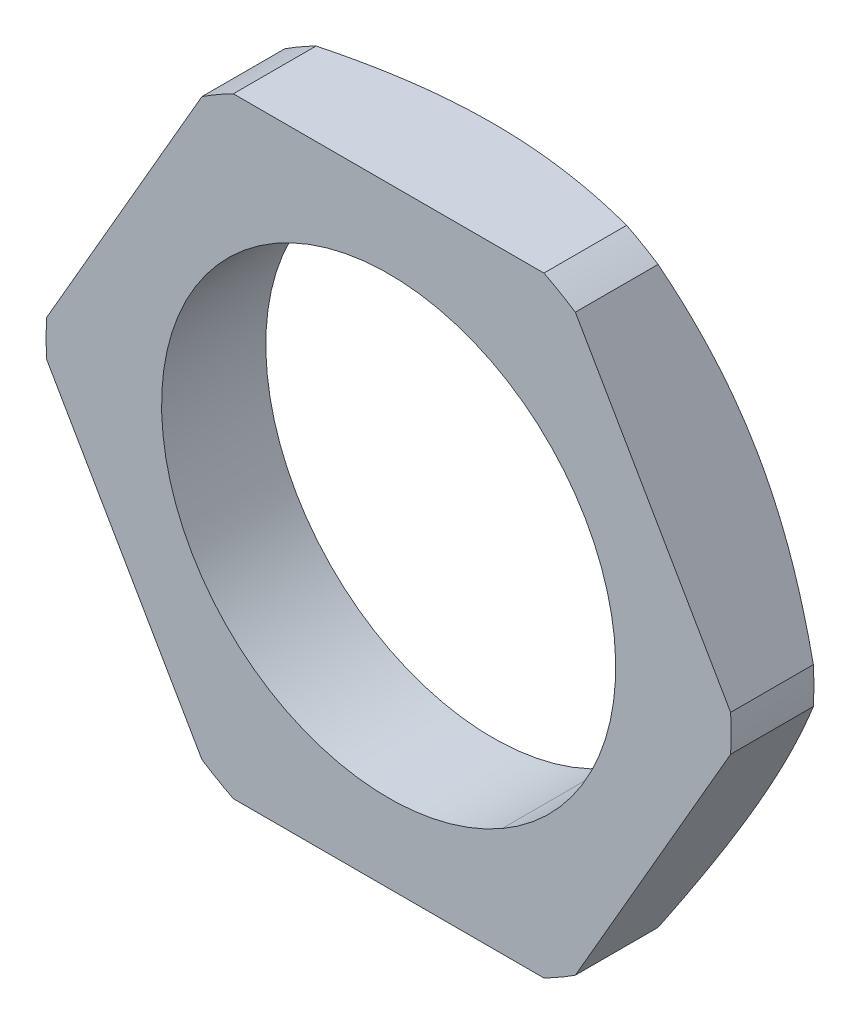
ISO-10303-21;
HEADER;
FILE_DESCRIPTION(('STEP AP214'),'2;1');
FILE_NAME('part.step','',(''),(''),'','','');
FILE_SCHEMA(('AUTOMOTIVE_DESIGN { 1 0 10303 214 1 1 1 1 }'));
ENDSEC;
DATA;
#1=APPLICATION_CONTEXT('core data for automotive mechanical design processes');
#2=APPLICATION_PROTOCOL_DEFINITION('international standard','automotive_design',2000,#1);
#3=PRODUCT_CONTEXT('',#1,'mechanical');
#4=PRODUCT('Part','Part','',(#3));
#5=PRODUCT_RELATED_PRODUCT_CATEGORY('part','',(#4));
#6=PRODUCT_DEFINITION_FORMATION('','',#4);
#7=PRODUCT_DEFINITION_CONTEXT('part definition',#1,'design');
#8=PRODUCT_DEFINITION('design','',#6,#7);
#9=PRODUCT_DEFINITION_SHAPE('','',#8);
#10=(LENGTH_UNIT() NAMED_UNIT(*) SI_UNIT(.MILLI.,.METRE.));
#11=(NAMED_UNIT(*) PLANE_ANGLE_UNIT() SI_UNIT($,.RADIAN.));
#12=(NAMED_UNIT(*) SI_UNIT($,.STERADIAN.) SOLID_ANGLE_UNIT());
#13=UNCERTAINTY_MEASURE_WITH_UNIT(LENGTH_MEASURE(1.E-05),#10,'distance_accuracy_value','');
#14=(GEOMETRIC_REPRESENTATION_CONTEXT(3) GLOBAL_UNCERTAINTY_ASSIGNED_CONTEXT((#13)) GLOBAL_UNIT_ASSIGNED_CONTEXT((#10,
#11,#12)) REPRESENTATION_CONTEXT('',''));
#15=CARTESIAN_POINT('',(0.,0.,0.));
#16=DIRECTION('',(0.,0.,1.));
#17=DIRECTION('',(1.,0.,0.));
#18=AXIS2_PLACEMENT_3D('',#15,#16,#17);
#19=CARTESIAN_POINT('',(0.,0.,7.03183294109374));
#20=DIRECTION('',(0.,0.,1.));
#21=DIRECTION('',(0.5,-0.866025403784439,0.));
#22=AXIS2_PLACEMENT_3D('',#19,#20,#21);
#23=CONICAL_SURFACE('',#22,50.,1.0471975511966);
#24=CARTESIAN_POINT('',(0.,20.5000000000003,-10.));
#25=CARTESIAN_POINT('',(0.219931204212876,20.499993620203,-10.0000069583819));
#26=CARTESIAN_POINT('',(0.439862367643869,20.4999760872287,-9.99797053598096));
#27=CARTESIAN_POINT('',(0.879432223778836,20.4999441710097,-9.98982377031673));
#28=CARTESIAN_POINT('',(1.09907099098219,20.499929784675,-9.98371744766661));
#29=CARTESIAN_POINT('',(1.53850605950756,20.4999295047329,-9.96743227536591));
#30=CARTESIAN_POINT('',(1.75830214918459,20.4999436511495,-9.95724772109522));
#31=CARTESIAN_POINT('',(2.19849827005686,20.4999784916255,-9.93281895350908));
#32=CARTESIAN_POINT('',(2.41889745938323,20.4999992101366,-9.91855959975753));
#33=CARTESIAN_POINT('',(2.85733726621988,20.5000007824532,-9.88623732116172));
#34=CARTESIAN_POINT('',(3.07538061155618,20.4999820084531,-9.86821133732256));
#35=CARTESIAN_POINT('',(3.51157632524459,20.4999534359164,-9.8282829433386));
#36=CARTESIAN_POINT('',(3.72972795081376,20.4999436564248,-9.80637242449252));
#37=CARTESIAN_POINT('',(4.16653344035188,20.4999450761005,-9.75868363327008));
#38=CARTESIAN_POINT('',(4.38518557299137,20.4999563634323,-9.73288952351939));
#39=CARTESIAN_POINT('',(4.82337538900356,20.4999830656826,-9.67744222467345));
#40=CARTESIAN_POINT('',(5.04291016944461,20.4999985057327,-9.64776612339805));
#41=CARTESIAN_POINT('',(5.47750852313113,20.5000014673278,-9.58537898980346));
#42=CARTESIAN_POINT('',(5.69258134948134,20.4999894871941,-9.55273231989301));
#43=CARTESIAN_POINT('',(6.12332886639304,20.499972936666,-9.48387919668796));
#44=CARTESIAN_POINT('',(6.33900067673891,20.4999684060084,-9.44765473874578));
#45=CARTESIAN_POINT('',(6.77125002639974,20.4999717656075,-9.37165228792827));
#46=CARTESIAN_POINT('',(6.98782355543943,20.4999797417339,-9.33185151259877));
#47=CARTESIAN_POINT('',(7.42216784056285,20.4999965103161,-9.24870176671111));
#48=CARTESIAN_POINT('',(7.63993343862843,20.5000053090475,-9.20532587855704));
#49=CARTESIAN_POINT('',(8.07007795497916,20.5000063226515,-9.11644349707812));
#50=CARTESIAN_POINT('',(8.28247075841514,20.4999988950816,-9.07100411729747));
#51=CARTESIAN_POINT('',(8.70835570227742,20.4999884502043,-8.97688367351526));
#52=CARTESIAN_POINT('',(8.92184265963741,20.4999854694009,-8.92817917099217));
#53=CARTESIAN_POINT('',(9.35013262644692,20.4999854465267,-8.82753220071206));
#54=CARTESIAN_POINT('',(9.56492957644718,20.4999884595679,-8.77556397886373));
#55=CARTESIAN_POINT('',(9.9960455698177,20.4999951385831,-8.66839154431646));
#56=CARTESIAN_POINT('',(10.212357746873,20.4999988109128,-8.61315969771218));
#57=CARTESIAN_POINT('',(10.4283268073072,20.5000000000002,-8.55662432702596));
#58=B_SPLINE_CURVE_WITH_KNOTS('',3,(#24,#25,#26,#27,#28,#29,#30,#31,#32,#33,#34,#35,#36,#37,#38,
#39,#40,#41,#42,#43,#44,#45,#46,#47,#48,#49,#50,#51,#52,#53,#54,#55,#56,#57),.UNSPECIFIED.,.F.,
.F.,(4,2,2,2,2,2,2,2,2,2,2,2,2,2,2,2,4),(0.,0.659783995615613,1.31891716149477,1.97897556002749,
2.64151910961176,3.29784655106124,3.95556051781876,4.61603318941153,5.28059657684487,
5.93317862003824,6.58923048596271,7.24980646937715,7.91591319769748,8.56749012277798,
9.22438703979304,9.887351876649,10.5570891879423),.UNSPECIFIED.);
#59=CARTESIAN_POINT('',(0.,20.5,-10.));
#60=VERTEX_POINT('',#59);
#61=CARTESIAN_POINT('',(10.4283268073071,20.5,-8.55662432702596));
#62=VERTEX_POINT('',#61);
#63=EDGE_CURVE('E892',#60,#62,#58,.T.);
#64=ORIENTED_EDGE('',*,*,#63,.T.);
#65=CARTESIAN_POINT('',(0.,0.,-8.55662432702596));
#66=DIRECTION('',(0.,0.,-1.));
#67=DIRECTION('',(0.5,-0.866025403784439,0.));
#68=AXIS2_PLACEMENT_3D('',#65,#66,#67);
#69=CIRCLE('',#68,23.);
#70=CARTESIAN_POINT('',(12.5393573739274,19.2811959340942,-8.55662432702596));
#71=VERTEX_POINT('',#70);
#72=EDGE_CURVE('E896',#62,#71,#69,.T.);
#73=ORIENTED_EDGE('',*,*,#72,.T.);
#74=CARTESIAN_POINT('',(12.5393573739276,19.2811959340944,-8.55662432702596));
#75=CARTESIAN_POINT('',(12.6860308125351,19.0271435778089,-8.63341686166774));
#76=CARTESIAN_POINT('',(12.8329805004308,18.7725221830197,-8.70782607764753));
#77=CARTESIAN_POINT('',(13.1253057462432,18.2659563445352,-8.85043797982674));
#78=CARTESIAN_POINT('',(13.2706724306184,18.0140280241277,-8.91871619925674));
#79=CARTESIAN_POINT('',(13.5601593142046,17.5124060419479,-9.04907156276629));
#80=CARTESIAN_POINT('',(13.7042713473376,17.2627255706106,-9.11121743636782));
#81=CARTESIAN_POINT('',(13.9915605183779,16.7651065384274,-9.22931618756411));
#82=CARTESIAN_POINT('',(14.1347309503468,16.5171782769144,-9.28532868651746));
#83=CARTESIAN_POINT('',(14.4204415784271,16.0225185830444,-9.39116791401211));
#84=CARTESIAN_POINT('',(14.5629769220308,15.7757946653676,-9.44104278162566));
#85=CARTESIAN_POINT('',(14.8476794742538,15.2829329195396,-9.53462857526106));
#86=CARTESIAN_POINT('',(14.9898439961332,15.0368000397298,-9.57837369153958));
#87=CARTESIAN_POINT('',(15.277715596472,14.5382495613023,-9.66070893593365));
#88=CARTESIAN_POINT('',(15.4234310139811,14.2858141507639,-9.69916244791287));
#89=CARTESIAN_POINT('',(15.7143327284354,13.7819649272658,-9.76916469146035));
#90=CARTESIAN_POINT('',(15.8595160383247,13.530555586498,-9.8007579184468));
#91=CARTESIAN_POINT('',(16.1497749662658,13.0279605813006,-9.85706880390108));
#92=CARTESIAN_POINT('',(16.2948495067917,12.7767766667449,-9.88180760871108));
#93=CARTESIAN_POINT('',(16.586156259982,12.2722096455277,-9.92457035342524));
#94=CARTESIAN_POINT('',(16.7323896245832,12.0188232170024,-9.94254738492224));
#95=CARTESIAN_POINT('',(17.0244030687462,11.5128931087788,-9.97126941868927));
#96=CARTESIAN_POINT('',(17.170182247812,11.2603507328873,-9.98204642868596));
#97=CARTESIAN_POINT('',(17.4618100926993,10.7552034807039,-9.99642171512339));
#98=CARTESIAN_POINT('',(17.6076587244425,10.5025986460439,-10.0000221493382));
#99=CARTESIAN_POINT('',(17.7535207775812,10.2500000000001,-10.));
#100=B_SPLINE_CURVE_WITH_KNOTS('',3,(#74,#75,#76,#77,#78,#79,#80,#81,#82,#83,#84,#85,#86,#87,
#88,#89,#90,#91,#92,#93,#94,#95,#96,#97,#98,#99),.UNSPECIFIED.,.F.,.F.,(4,2,2,2,2,2,2,2,2,2,2,2,
4),(0.,0.909711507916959,1.8059649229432,2.69063691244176,3.56575705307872,4.43350434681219,
5.2962004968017,6.178123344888,7.05414289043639,7.92742897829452,8.80666621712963,
9.68196832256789,10.5570072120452),.UNSPECIFIED.);
#101=CARTESIAN_POINT('',(17.753520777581,10.25,-10.));
#102=VERTEX_POINT('',#101);
#103=EDGE_CURVE('E390',#71,#102,#100,.T.);
#104=ORIENTED_EDGE('',*,*,#103,.T.);
#105=CARTESIAN_POINT('',(0.,0.,-10.));
#106=DIRECTION('',(0.,0.,1.));
#107=DIRECTION('',(0.5,-0.866025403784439,0.));
#108=AXIS2_PLACEMENT_3D('',#105,#106,#107);
#109=CIRCLE('',#108,20.5);
#110=EDGE_CURVE('E356',#102,#60,#109,.T.);
#111=ORIENTED_EDGE('',*,*,#110,.T.);
#112=EDGE_LOOP('',(#64,#73,#104,#111));
#113=FACE_BOUND('',#112,.T.);
#114=ADVANCED_FACE('F16',(#113),#23,.T.);
#115=CARTESIAN_POINT('',(0.,0.,7.03183294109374));
#116=DIRECTION('',(0.,0.,1.));
#117=DIRECTION('',(0.5,-0.866025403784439,0.));
#118=AXIS2_PLACEMENT_3D('',#115,#116,#117);
#119=CONICAL_SURFACE('',#118,50.,1.0471975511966);
#120=CARTESIAN_POINT('',(17.7535207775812,10.2500000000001,-10.));
#121=CARTESIAN_POINT('',(17.8634601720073,10.0595666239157,-10.0000069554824));
#122=CARTESIAN_POINT('',(17.9733898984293,9.86912771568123,-9.99797129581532));
#123=CARTESIAN_POINT('',(18.193105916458,9.48850462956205,-9.98982758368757));
#124=CARTESIAN_POINT('',(18.3028922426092,9.29832038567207,-9.98372354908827));
#125=CARTESIAN_POINT('',(18.522568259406,8.91782978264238,-9.9674444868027));
#126=CARTESIAN_POINT('',(18.6324578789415,8.72752362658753,-9.95726375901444));
#127=CARTESIAN_POINT('',(18.8525446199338,8.34639190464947,-9.93284413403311));
#128=CARTESIAN_POINT('',(18.9627413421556,8.15556707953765,-9.91859010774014));
#129=CARTESIAN_POINT('',(19.1825894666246,7.7747818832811,-9.88618145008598));
#130=CARTESIAN_POINT('',(19.2922414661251,7.58482074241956,-9.86803989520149));
#131=CARTESIAN_POINT('',(19.5116079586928,7.20480848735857,-9.82783461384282));
#132=CARTESIAN_POINT('',(19.6213220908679,7.01475803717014,-9.80576264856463));
#133=CARTESIAN_POINT('',(19.8410235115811,6.63422674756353,-9.75770545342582));
#134=CARTESIAN_POINT('',(19.9510099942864,6.44374748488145,-9.73170407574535));
#135=CARTESIAN_POINT('',(20.1714366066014,6.06201252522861,-9.67579664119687));
#136=CARTESIAN_POINT('',(20.2818752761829,5.87075941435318,-9.64586719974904));
#137=CARTESIAN_POINT('',(20.4998661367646,5.49319238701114,-9.58311392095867));
#138=CARTESIAN_POINT('',(20.6074250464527,5.30686823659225,-9.55037486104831));
#139=CARTESIAN_POINT('',(20.8228411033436,4.93371403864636,-9.48134009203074));
#140=CARTESIAN_POINT('',(20.9306968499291,4.74688647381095,-9.44502660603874));
#141=CARTESIAN_POINT('',(21.1468643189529,4.37246659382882,-9.36884895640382));
#142=CARTESIAN_POINT('',(21.2551741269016,4.18487776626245,-9.3289622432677));
#143=CARTESIAN_POINT('',(21.4723864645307,3.80867855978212,-9.24564353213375));
#144=CARTESIAN_POINT('',(21.5812864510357,3.62007262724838,-9.20218485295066));
#145=CARTESIAN_POINT('',(21.7957132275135,3.24867713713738,-9.11341554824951));
#146=CARTESIAN_POINT('',(21.9012492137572,3.06587237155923,-9.06819065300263));
#147=CARTESIAN_POINT('',(22.1128792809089,2.6993079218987,-8.9745353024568));
#148=CARTESIAN_POINT('',(22.2189708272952,2.51555272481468,-8.92608157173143));
#149=CARTESIAN_POINT('',(22.4318184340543,2.146902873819,-8.82597217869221));
#150=CARTESIAN_POINT('',(22.5385715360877,1.9620134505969,-8.77429099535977));
#151=CARTESIAN_POINT('',(22.7528377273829,1.59091633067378,-8.66772858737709));
#152=CARTESIAN_POINT('',(22.8603474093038,1.40471451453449,-8.61282001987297));
#153=CARTESIAN_POINT('',(22.9676841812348,1.2188040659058,-8.55662432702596));
#154=B_SPLINE_CURVE_WITH_KNOTS('',3,(#120,#121,#122,#123,#124,#125,#126,#127,#128,#129,#130,
#131,#132,#133,#134,#135,#136,#137,#138,#139,#140,#141,#142,#143,#144,#145,#146,#147,#148,#149,
#150,#151,#152,#153),.UNSPECIFIED.,.F.,.F.,(4,2,2,2,2,2,2,2,2,2,2,2,2,2,2,2,4),(0.,
0.659659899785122,1.31866929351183,1.97860336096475,2.64102115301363,3.30124479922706,
3.96286903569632,4.62729010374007,5.29586306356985,5.9486887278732,6.60494311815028,
7.26567808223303,7.9318978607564,8.57949394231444,9.2324083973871,9.89137618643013,
10.5570898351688),.UNSPECIFIED.);
#155=CARTESIAN_POINT('',(22.9676841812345,1.21880406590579,-8.55662432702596));
#156=VERTEX_POINT('',#155);
#157=EDGE_CURVE('E389',#102,#156,#154,.T.);
#158=ORIENTED_EDGE('',*,*,#157,.T.);
#159=CARTESIAN_POINT('',(0.,0.,-8.55662432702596));
#160=DIRECTION('',(0.,0.,-1.));
#161=DIRECTION('',(0.499999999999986,-0.866025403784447,0.));
#162=AXIS2_PLACEMENT_3D('',#159,#160,#161);
#163=CIRCLE('',#162,23.);
#164=CARTESIAN_POINT('',(22.9676841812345,-1.21880406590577,-8.55662432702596));
#165=VERTEX_POINT('',#164);
#166=EDGE_CURVE('E449',#156,#165,#163,.T.);
#167=ORIENTED_EDGE('',*,*,#166,.T.);
#168=CARTESIAN_POINT('',(22.9676841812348,-1.21880406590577,-8.55662432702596));
#169=CARTESIAN_POINT('',(22.8212816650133,-1.47237419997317,-8.63327207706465));
#170=CARTESIAN_POINT('',(22.6745260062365,-1.72646623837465,-8.70754535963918));
#171=CARTESIAN_POINT('',(22.3825397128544,-2.23195981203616,-8.84990946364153));
#172=CARTESIAN_POINT('',(22.2373185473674,-2.48334569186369,-8.91807536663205));
#173=CARTESIAN_POINT('',(21.9481831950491,-2.98392871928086,-9.04823012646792));
#174=CARTESIAN_POINT('',(21.8042763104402,-3.23311227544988,-9.11028731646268));
#175=CARTESIAN_POINT('',(21.5175001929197,-3.72980369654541,-9.22823265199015));
#176=CARTESIAN_POINT('',(21.3746365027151,-3.97730065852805,-9.28418010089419));
#177=CARTESIAN_POINT('',(21.0896289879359,-4.47115192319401,-9.38991315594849));
#178=CARTESIAN_POINT('',(20.9474892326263,-4.71749829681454,-9.43974668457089));
#179=CARTESIAN_POINT('',(20.6635346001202,-5.2095776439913,-9.53327339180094));
#180=CARTESIAN_POINT('',(20.5217226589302,-5.45530582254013,-9.57700067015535));
#181=CARTESIAN_POINT('',(20.2341452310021,-5.95346096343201,-9.65940806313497));
#182=CARTESIAN_POINT('',(20.0883674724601,-6.205905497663,-9.69793956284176));
#183=CARTESIAN_POINT('',(19.7974368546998,-6.70981562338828,-9.76809674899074));
#184=CARTESIAN_POINT('',(19.652286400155,-6.96127635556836,-9.79976720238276));
#185=CARTESIAN_POINT('',(19.362131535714,-7.46398346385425,-9.85623120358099));
#186=CARTESIAN_POINT('',(19.2171281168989,-7.71522800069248,-9.8810461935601));
#187=CARTESIAN_POINT('',(18.9252867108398,-8.22070321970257,-9.92403665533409));
#188=CARTESIAN_POINT('',(18.7784452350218,-8.47493795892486,-9.94214095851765));
#189=CARTESIAN_POINT('',(18.4852665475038,-8.98259355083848,-9.97106624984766));
#190=CARTESIAN_POINT('',(18.3389300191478,-9.23601295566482,-9.98191946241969));
#191=CARTESIAN_POINT('',(18.0462320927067,-9.74295220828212,-9.99639659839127));
#192=CARTESIAN_POINT('',(17.8998707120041,-9.99647201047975,-10.0000224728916));
#193=CARTESIAN_POINT('',(17.7535207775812,-10.2500000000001,-10.));
#194=B_SPLINE_CURVE_WITH_KNOTS('',3,(#168,#169,#170,#171,#172,#173,#174,#175,#176,#177,#178,
#179,#180,#181,#182,#183,#184,#185,#186,#187,#188,#189,#190,#191,#192,#193),.UNSPECIFIED.,.F.,
.F.,(4,2,2,2,2,2,2,2,2,2,2,2,4),(0.,0.907996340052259,1.80258850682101,2.68564190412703,
3.55917367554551,4.42534926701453,5.28647578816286,6.16854548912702,7.04467388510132,
7.91803011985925,8.8004001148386,9.67882223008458,10.5570071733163),.UNSPECIFIED.);
#195=CARTESIAN_POINT('',(17.753520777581,-10.25,-10.));
#196=VERTEX_POINT('',#195);
#197=EDGE_CURVE('E268',#165,#196,#194,.T.);
#198=ORIENTED_EDGE('',*,*,#197,.T.);
#199=CARTESIAN_POINT('',(0.,0.,-10.));
#200=DIRECTION('',(0.,0.,1.));
#201=DIRECTION('',(0.5,-0.866025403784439,0.));
#202=AXIS2_PLACEMENT_3D('',#199,#200,#201);
#203=CIRCLE('',#202,20.5);
#204=EDGE_CURVE('E352',#196,#102,#203,.T.);
#205=ORIENTED_EDGE('',*,*,#204,.T.);
#206=EDGE_LOOP('',(#158,#167,#198,#205));
#207=FACE_BOUND('',#206,.T.);
#208=ADVANCED_FACE('F473',(#207),#119,.T.);
#209=CARTESIAN_POINT('',(0.,0.,7.03183294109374));
#210=DIRECTION('',(0.,0.,1.));
#211=DIRECTION('',(0.5,-0.866025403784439,0.));
#212=AXIS2_PLACEMENT_3D('',#209,#210,#211);
#213=CONICAL_SURFACE('',#212,50.,1.0471975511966);
#214=CARTESIAN_POINT('',(0.,0.,-8.55662432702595));
#215=DIRECTION('',(0.,0.,-1.));
#216=DIRECTION('',(0.500000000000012,-0.866025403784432,0.));
#217=AXIS2_PLACEMENT_3D('',#214,#215,#216);
#218=CIRCLE('',#217,23.);
#219=CARTESIAN_POINT('',(-12.5393573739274,19.2811959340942,-8.55662432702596));
#220=VERTEX_POINT('',#219);
#221=CARTESIAN_POINT('',(-10.4283268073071,20.5,-8.55662432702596));
#222=VERTEX_POINT('',#221);
#223=EDGE_CURVE('E355',#220,#222,#218,.T.);
#224=ORIENTED_EDGE('',*,*,#223,.T.);
#225=CARTESIAN_POINT('',(-10.4283268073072,20.5000000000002,-8.55662432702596));
#226=CARTESIAN_POINT('',(-10.1355273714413,20.4999967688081,-8.63327207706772));
#227=CARTESIAN_POINT('',(-9.84209938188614,20.4999486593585,-8.70754535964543));
#228=CARTESIAN_POINT('',(-9.25833595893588,20.4998278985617,-8.84990946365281));
#229=CARTESIAN_POINT('',(-8.96801881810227,20.4997556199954,-8.91807536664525));
#230=CARTESIAN_POINT('',(-8.38993352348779,20.4996485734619,-9.04823012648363));
#231=CARTESIAN_POINT('',(-8.10218079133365,20.4996133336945,-9.11028731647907));
#232=CARTESIAN_POINT('',(-7.52864534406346,20.4996036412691,-9.22823265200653));
#233=CARTESIAN_POINT('',(-7.24287484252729,20.4996285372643,-9.28418010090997));
#234=CARTESIAN_POINT('',(-6.67268334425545,20.4997304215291,-9.38991315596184));
#235=CARTESIAN_POINT('',(-6.38827124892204,20.4998069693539,-9.4397466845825));
#236=CARTESIAN_POINT('',(-5.82014071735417,20.4999347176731,-9.53327339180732));
#237=CARTESIAN_POINT('',(-5.53642790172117,20.4999860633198,-9.57700067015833));
#238=CARTESIAN_POINT('',(-4.96122418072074,20.5000142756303,-9.65940806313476));
#239=CARTESIAN_POINT('',(-4.66971192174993,20.499989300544,-9.69793956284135));
#240=CARTESIAN_POINT('',(-4.08784764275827,20.4999910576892,-9.76809674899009));
#241=CARTESIAN_POINT('',(-3.79750103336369,20.5000174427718,-9.79976720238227));
#242=CARTESIAN_POINT('',(-3.21706647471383,20.5000895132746,-9.85623120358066));
#243=CARTESIAN_POINT('',(-2.92698061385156,20.5001351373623,-9.88104619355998));
#244=CARTESIAN_POINT('',(-2.34330553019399,20.5001306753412,-9.92403665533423));
#245=CARTESIAN_POINT('',(-2.04971104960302,20.5000795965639,-9.94214095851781));
#246=CARTESIAN_POINT('',(-1.46347906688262,20.5000072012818,-9.97106624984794));
#247=CARTESIAN_POINT('',(-1.1708431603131,20.4999857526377,-9.98191946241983));
#248=CARTESIAN_POINT('',(-0.585471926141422,20.4999715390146,-9.99639659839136));
#249=CARTESIAN_POINT('',(-0.292736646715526,20.4999787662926,-10.0000224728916));
#250=CARTESIAN_POINT('',(0.,20.5000000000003,-10.));
#251=B_SPLINE_CURVE_WITH_KNOTS('',3,(#225,#226,#227,#228,#229,#230,#231,#232,#233,#234,#235,
#236,#237,#238,#239,#240,#241,#242,#243,#244,#245,#246,#247,#248,#249,#250),.UNSPECIFIED.,.F.,
.F.,(4,2,2,2,2,2,2,2,2,2,2,2,4),(0.,0.907996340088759,1.80258850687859,2.68564190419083,
3.55917367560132,4.42534926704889,5.2864757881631,6.16854548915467,7.04467388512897,
7.9180301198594,8.8004001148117,9.67882223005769,10.5570071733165),.UNSPECIFIED.);
#252=EDGE_CURVE('E854',#222,#60,#251,.T.);
#253=ORIENTED_EDGE('',*,*,#252,.T.);
#254=CARTESIAN_POINT('',(0.,0.,-10.));
#255=DIRECTION('',(0.,0.,1.));
#256=DIRECTION('',(0.5,-0.866025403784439,0.));
#257=AXIS2_PLACEMENT_3D('',#254,#255,#256);
#258=CIRCLE('',#257,20.5);
#259=CARTESIAN_POINT('',(-17.753520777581,10.25,-10.));
#260=VERTEX_POINT('',#259);
#261=EDGE_CURVE('E367',#60,#260,#258,.T.);
#262=ORIENTED_EDGE('',*,*,#261,.T.);
#263=CARTESIAN_POINT('',(-17.7535207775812,10.2500000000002,-10.));
#264=CARTESIAN_POINT('',(-17.643549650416,10.4404628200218,-10.0000069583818));
#265=CARTESIAN_POINT('',(-17.5335688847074,10.6309200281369,-9.99797053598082));
#266=CARTESIAN_POINT('',(-17.3137563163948,11.0115827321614,-9.98982377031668));
#267=CARTESIAN_POINT('',(-17.2039244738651,11.2017882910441,-9.98371744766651));
#268=CARTESIAN_POINT('',(-16.9842066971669,11.5823500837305,-9.96743227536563));
#269=CARTESIAN_POINT('',(-16.8743209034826,11.7727061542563,-9.95724772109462));
#270=CARTESIAN_POINT('',(-16.6542530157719,12.1539445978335,-9.93281895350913));
#271=CARTESIAN_POINT('',(-16.5440713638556,12.344826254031,-9.91855959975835));
#272=CARTESIAN_POINT('',(-16.3248528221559,12.7245270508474,-9.88623732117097));
#273=CARTESIAN_POINT('',(-16.215814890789,12.9133487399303,-9.86821133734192));
#274=CARTESIAN_POINT('',(-15.9976922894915,13.2910910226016,-9.82828294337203));
#275=CARTESIAN_POINT('',(-15.8886080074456,13.4800109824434,-9.8063724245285));
#276=CARTESIAN_POINT('',(-15.6702064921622,13.8582963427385,-9.75868363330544));
#277=CARTESIAN_POINT('',(-15.5608902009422,14.0476602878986,-9.73288952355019));
#278=CARTESIAN_POINT('',(-15.3418184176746,14.427157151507,-9.67744222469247));
#279=CARTESIAN_POINT('',(-15.2320643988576,14.6172875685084,-9.64776612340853));
#280=CARTESIAN_POINT('',(-15.0147677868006,14.9936622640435,-9.58537898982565));
#281=CARTESIAN_POINT('',(-14.9072209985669,15.1799148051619,-9.55273231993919));
#282=CARTESIAN_POINT('',(-14.6918329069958,15.5529448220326,-9.48387919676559));
#283=CARTESIAN_POINT('',(-14.5839930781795,15.7397198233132,-9.44765473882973));
#284=CARTESIAN_POINT('',(-14.3678713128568,16.1140604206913,-9.37165228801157));
#285=CARTESIAN_POINT('',(-14.2595914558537,16.3016225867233,-9.331851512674));
#286=CARTESIAN_POINT('',(-14.042433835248,16.6777841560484,-9.24870176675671));
#287=CARTESIAN_POINT('',(-13.9335586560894,16.8663790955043,-9.20532587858));
#288=CARTESIAN_POINT('',(-13.7184872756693,17.238895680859,-9.11644349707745));
#289=CARTESIAN_POINT('',(-13.6122844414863,17.4228295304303,-9.07100411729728));
#290=CARTESIAN_POINT('',(-13.3993329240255,17.7916514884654,-8.97688367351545));
#291=CARTESIAN_POINT('',(-13.2925868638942,17.9765351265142,-8.92817917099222));
#292=CARTESIAN_POINT('',(-13.07844186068,18.3474451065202,-8.82753220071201));
#293=CARTESIAN_POINT('',(-12.97104599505,18.5334662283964,-8.7755639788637));
#294=CARTESIAN_POINT('',(-12.7554937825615,18.9068269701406,-8.66839154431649));
#295=CARTESIAN_POINT('',(-12.6473408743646,19.0941606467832,-8.61315969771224));
#296=CARTESIAN_POINT('',(-12.5393573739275,19.2811959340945,-8.55662432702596));
#297=B_SPLINE_CURVE_WITH_KNOTS('',3,(#263,#264,#265,#266,#267,#268,#269,#270,#271,#272,#273,
#274,#275,#276,#277,#278,#279,#280,#281,#282,#283,#284,#285,#286,#287,#288,#289,#290,#291,#292,
#293,#294,#295,#296),.UNSPECIFIED.,.F.,.F.,(4,2,2,2,2,2,2,2,2,2,2,2,2,2,2,2,4),(0.,
0.659783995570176,1.31891716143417,1.97897555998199,2.64151910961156,3.297846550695,
3.95556051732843,4.61603318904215,5.2805965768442,5.93317861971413,6.58923048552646,
7.24980646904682,7.91591319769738,8.56749012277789,9.22438703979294,9.8873518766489,
10.5570891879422),.UNSPECIFIED.);
#298=EDGE_CURVE('E185',#260,#220,#297,.T.);
#299=ORIENTED_EDGE('',*,*,#298,.T.);
#300=EDGE_LOOP('',(#224,#253,#262,#299));
#301=FACE_BOUND('',#300,.T.);
#302=ADVANCED_FACE('F481',(#301),#213,.T.);
#303=CARTESIAN_POINT('',(0.,0.,7.03183294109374));
#304=DIRECTION('',(0.,0.,1.));
#305=DIRECTION('',(0.5,-0.866025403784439,0.));
#306=AXIS2_PLACEMENT_3D('',#303,#304,#305);
#307=CONICAL_SURFACE('',#306,50.,1.0471975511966);
#308=CARTESIAN_POINT('',(-22.9676841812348,1.21880406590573,-8.55662432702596));
#309=CARTESIAN_POINT('',(-22.8212816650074,1.47237419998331,-8.63327207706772));
#310=CARTESIAN_POINT('',(-22.6745260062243,1.72646623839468,-8.70754535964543));
#311=CARTESIAN_POINT('',(-22.3825397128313,2.23195981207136,-8.84990946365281));
#312=CARTESIAN_POINT('',(-22.2373185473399,2.48334569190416,-8.91807536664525));
#313=CARTESIAN_POINT('',(-21.9481831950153,2.98392871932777,-9.04823012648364));
#314=CARTESIAN_POINT('',(-21.8042763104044,3.23311227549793,-9.11028731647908));
#315=CARTESIAN_POINT('',(-21.5175001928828,3.72980369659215,-9.22823265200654));
#316=CARTESIAN_POINT('',(-21.374636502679,3.97730065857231,-9.28418010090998));
#317=CARTESIAN_POINT('',(-21.0896289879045,4.47115192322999,-9.38991315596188));
#318=CARTESIAN_POINT('',(-20.9474892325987,4.7174982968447,-9.43974668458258));
#319=CARTESIAN_POINT('',(-20.6635346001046,5.20957764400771,-9.53327339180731));
#320=CARTESIAN_POINT('',(-20.5217226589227,5.4553058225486,-9.57700067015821));
#321=CARTESIAN_POINT('',(-20.2341452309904,5.95346096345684,-9.65940806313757));
#322=CARTESIAN_POINT('',(-20.0883674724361,6.20590549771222,-9.69793956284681));
#323=CARTESIAN_POINT('',(-19.7974368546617,6.70981562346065,-9.7680967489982));
#324=CARTESIAN_POINT('',(-19.6522864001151,6.96127635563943,-9.79976720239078));
#325=CARTESIAN_POINT('',(-19.362131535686,7.46398346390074,-9.85623120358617));
#326=CARTESIAN_POINT('',(-19.2171281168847,7.71522800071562,-9.88104619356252));
#327=CARTESIAN_POINT('',(-18.9252867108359,8.2207032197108,-9.92403665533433));
#328=CARTESIAN_POINT('',(-18.7784452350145,8.47493795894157,-9.94214095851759));
#329=CARTESIAN_POINT('',(-18.4852665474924,8.98259355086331,-9.97106624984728));
#330=CARTESIAN_POINT('',(-18.3389300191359,9.23601295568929,-9.9819194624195));
#331=CARTESIAN_POINT('',(-18.046232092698,9.74295220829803,-9.99639659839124));
#332=CARTESIAN_POINT('',(-17.8998707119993,9.99647201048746,-10.0000224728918));
#333=CARTESIAN_POINT('',(-17.7535207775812,10.2500000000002,-10.));
#334=B_SPLINE_CURVE_WITH_KNOTS('',3,(#308,#309,#310,#311,#312,#313,#314,#315,#316,#317,#318,
#319,#320,#321,#322,#323,#324,#325,#326,#327,#328,#329,#330,#331,#332,#333),.UNSPECIFIED.,.F.,
.F.,(4,2,2,2,2,2,2,2,2,2,2,2,4),(0.,0.907996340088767,1.80258850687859,2.68564190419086,
3.5591736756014,4.425349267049,5.28647578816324,6.16854548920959,7.04467388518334,
7.9180301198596,8.800400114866,9.67882223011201,10.5570071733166),.UNSPECIFIED.);
#335=CARTESIAN_POINT('',(-22.9676841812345,1.21880406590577,-8.55662432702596));
#336=VERTEX_POINT('',#335);
#337=EDGE_CURVE('E457',#336,#260,#334,.T.);
#338=ORIENTED_EDGE('',*,*,#337,.T.);
#339=CARTESIAN_POINT('',(0.,0.,-10.));
#340=DIRECTION('',(0.,0.,1.));
#341=DIRECTION('',(0.5,-0.866025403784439,0.));
#342=AXIS2_PLACEMENT_3D('',#339,#340,#341);
#343=CIRCLE('',#342,20.5);
#344=CARTESIAN_POINT('',(-17.753520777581,-10.25,-10.));
#345=VERTEX_POINT('',#344);
#346=EDGE_CURVE('E159',#260,#345,#343,.T.);
#347=ORIENTED_EDGE('',*,*,#346,.T.);
#348=CARTESIAN_POINT('',(-17.7535207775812,-10.2500000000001,-10.));
#349=CARTESIAN_POINT('',(-17.8993427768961,-9.99738667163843,-10.0000222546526));
#350=CARTESIAN_POINT('',(-18.0451774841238,-9.74478227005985,-9.99642167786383));
#351=CARTESIAN_POINT('',(-18.3368312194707,-9.2396584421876,-9.98204628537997));
#352=CARTESIAN_POINT('',(-18.4826502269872,-8.98713907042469,-9.9712691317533));
#353=CARTESIAN_POINT('',(-18.774795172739,-8.48127641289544,-9.942547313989));
#354=CARTESIAN_POINT('',(-18.9211204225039,-8.22793456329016,-9.92457046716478));
#355=CARTESIAN_POINT('',(-19.2124300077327,-7.7233775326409,-9.88180909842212));
#356=CARTESIAN_POINT('',(-19.3574166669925,-7.47215966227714,-9.85707200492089));
#357=CARTESIAN_POINT('',(-19.6475404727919,-6.96950355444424,-9.80076286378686));
#358=CARTESIAN_POINT('',(-19.7926766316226,-6.71806715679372,-9.76916933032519));
#359=CARTESIAN_POINT('',(-20.0835799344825,-6.21420203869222,-9.69916558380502));
#360=CARTESIAN_POINT('',(-20.2293446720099,-5.96177817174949,-9.66071054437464));
#361=CARTESIAN_POINT('',(-20.5171698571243,-5.46318910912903,-9.57837480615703));
#362=CARTESIAN_POINT('',(-20.6592416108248,-5.2170077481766,-9.53463112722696));
#363=CARTESIAN_POINT('',(-20.943716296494,-4.72402273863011,-9.44104748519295));
#364=CARTESIAN_POINT('',(-21.0861162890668,-4.47722389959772,-9.39117329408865));
#365=CARTESIAN_POINT('',(-21.3716469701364,-3.98246472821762,-9.28533502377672));
#366=CARTESIAN_POINT('',(-21.514773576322,-3.73451236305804,-9.22932276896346));
#367=CARTESIAN_POINT('',(-21.8020801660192,-3.23690366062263,-9.11122402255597));
#368=CARTESIAN_POINT('',(-21.9462545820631,-2.98725828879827,-9.0490778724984));
#369=CARTESIAN_POINT('',(-22.2359310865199,-2.48574171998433,-8.91872149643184));
#370=CARTESIAN_POINT('',(-22.3814258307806,-2.23388419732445,-8.85044250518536));
#371=CARTESIAN_POINT('',(-22.673966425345,-1.72743409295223,-8.70782858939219));
#372=CARTESIAN_POINT('',(-22.8210027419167,-1.4728572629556,-8.63341809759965));
#373=CARTESIAN_POINT('',(-22.9676841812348,-1.2188040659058,-8.55662432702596));
#374=B_SPLINE_CURVE_WITH_KNOTS('',3,(#348,#349,#350,#351,#352,#353,#354,#355,#356,#357,#358,
#359,#360,#361,#362,#363,#364,#365,#366,#367,#368,#369,#370,#371,#372,#373),.UNSPECIFIED.,.F.,
.F.,(4,2,2,2,2,2,2,2,2,2,2,2,4),(0.,0.8750169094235,1.75031901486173,2.62957819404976,
3.50282039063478,4.37883960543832,5.26080667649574,6.12348912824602,6.99122781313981,
7.86634475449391,8.75101924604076,9.64728112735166,10.5570073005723),.UNSPECIFIED.);
#375=CARTESIAN_POINT('',(-22.9676841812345,-1.21880406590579,-8.55662432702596));
#376=VERTEX_POINT('',#375);
#377=EDGE_CURVE('E150',#345,#376,#374,.T.);
#378=ORIENTED_EDGE('',*,*,#377,.T.);
#379=CARTESIAN_POINT('',(0.,0.,-8.55662432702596));
#380=DIRECTION('',(0.,0.,-1.));
#381=DIRECTION('',(0.500000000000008,-0.866025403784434,0.));
#382=AXIS2_PLACEMENT_3D('',#379,#380,#381);
#383=CIRCLE('',#382,23.);
#384=EDGE_CURVE('E156',#376,#336,#383,.T.);
#385=ORIENTED_EDGE('',*,*,#384,.T.);
#386=EDGE_LOOP('',(#338,#347,#378,#385));
#387=FACE_BOUND('',#386,.T.);
#388=ADVANCED_FACE('F154',(#387),#307,.T.);
#389=CARTESIAN_POINT('',(0.,0.,7.03183294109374));
#390=DIRECTION('',(0.,0.,1.));
#391=DIRECTION('',(0.5,-0.866025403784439,0.));
#392=AXIS2_PLACEMENT_3D('',#389,#390,#391);
#393=CONICAL_SURFACE('',#392,50.,1.0471975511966);
#394=DIRECTION('',(0.433012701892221,-0.75,0.5));
#395=VECTOR('',#394,1.);
#396=CARTESIAN_POINT('',(25.,-43.3012701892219,7.03183294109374));
#397=LINE('',#396,#395);
#398=CARTESIAN_POINT('',(10.25,-17.753520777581,-10.));
#399=VERTEX_POINT('',#398);
#400=CARTESIAN_POINT('',(11.5,-19.9185842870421,-8.55662432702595));
#401=VERTEX_POINT('',#400);
#402=EDGE_CURVE('E275',#399,#401,#397,.T.);
#403=ORIENTED_EDGE('',*,*,#402,.F.);
#404=CARTESIAN_POINT('',(0.,0.,-10.));
#405=DIRECTION('',(0.,0.,1.));
#406=DIRECTION('',(0.5,-0.866025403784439,0.));
#407=AXIS2_PLACEMENT_3D('',#404,#405,#406);
#408=CIRCLE('',#407,20.5);
#409=EDGE_CURVE('E509',#399,#196,#408,.T.);
#410=ORIENTED_EDGE('',*,*,#409,.T.);
#411=CARTESIAN_POINT('',(17.7535207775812,-10.2500000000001,-10.));
#412=CARTESIAN_POINT('',(17.643549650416,-10.4404628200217,-10.0000069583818));
#413=CARTESIAN_POINT('',(17.5335688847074,-10.6309200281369,-9.99797053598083));
#414=CARTESIAN_POINT('',(17.3137563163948,-11.0115827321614,-9.98982377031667));
#415=CARTESIAN_POINT('',(17.2039244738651,-11.2017882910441,-9.9837174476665));
#416=CARTESIAN_POINT('',(16.9842066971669,-11.5823500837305,-9.96743227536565));
#417=CARTESIAN_POINT('',(16.8743209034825,-11.7727061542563,-9.95724772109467));
#418=CARTESIAN_POINT('',(16.6542530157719,-12.1539445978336,-9.93281895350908));
#419=CARTESIAN_POINT('',(16.5440713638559,-12.3448262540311,-9.91855959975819));
#420=CARTESIAN_POINT('',(16.3248528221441,-12.7245270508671,-9.88623732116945));
#421=CARTESIAN_POINT('',(16.2158148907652,-12.9133487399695,-9.86821133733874));
#422=CARTESIAN_POINT('',(15.9976922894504,-13.2910910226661,-9.82828294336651));
#423=CARTESIAN_POINT('',(15.8886080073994,-13.480010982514,-9.80637242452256));
#424=CARTESIAN_POINT('',(15.670206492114,-13.8582963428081,-9.7586836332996));
#425=CARTESIAN_POINT('',(15.5608902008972,-14.0476602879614,-9.73288952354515));
#426=CARTESIAN_POINT('',(15.3418184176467,-14.4271571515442,-9.67744222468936));
#427=CARTESIAN_POINT('',(15.2320643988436,-14.617287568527,-9.64776612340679));
#428=CARTESIAN_POINT('',(15.0147677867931,-14.993662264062,-9.58537898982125));
#429=CARTESIAN_POINT('',(14.907220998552,-15.1799148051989,-9.55273231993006));
#430=CARTESIAN_POINT('',(14.6918329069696,-15.5529448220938,-9.48387919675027));
#431=CARTESIAN_POINT('',(14.5839930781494,-15.7397198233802,-9.44765473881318));
#432=CARTESIAN_POINT('',(14.367871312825,-16.1140604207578,-9.37165228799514));
#433=CARTESIAN_POINT('',(14.2595914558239,-16.3016225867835,-9.33185151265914));
#434=CARTESIAN_POINT('',(14.0424338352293,-16.6777841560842,-9.2487017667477));
#435=CARTESIAN_POINT('',(13.9335586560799,-16.8663790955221,-9.20532587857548));
#436=CARTESIAN_POINT('',(13.7184872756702,-17.2388956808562,-9.11644349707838));
#437=CARTESIAN_POINT('',(13.6122844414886,-17.4228295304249,-9.07100411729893));
#438=CARTESIAN_POINT('',(13.3993329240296,-17.7916514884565,-8.9768836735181));
#439=CARTESIAN_POINT('',(13.2925868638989,-17.9765351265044,-8.92817917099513));
#440=CARTESIAN_POINT('',(13.0784418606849,-18.3474451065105,-8.82753220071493));
#441=CARTESIAN_POINT('',(12.9710459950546,-18.5334662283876,-8.77556397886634));
#442=CARTESIAN_POINT('',(12.7554937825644,-18.9068269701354,-8.66839154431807));
#443=CARTESIAN_POINT('',(12.6473408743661,-19.0941606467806,-8.61315969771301));
#444=CARTESIAN_POINT('',(12.5393573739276,-19.2811959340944,-8.55662432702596));
#445=B_SPLINE_CURVE_WITH_KNOTS('',3,(#411,#412,#413,#414,#415,#416,#417,#418,#419,#420,#421,
#422,#423,#424,#425,#426,#427,#428,#429,#430,#431,#432,#433,#434,#435,#436,#437,#438,#439,#440,
#441,#442,#443,#444),.UNSPECIFIED.,.F.,.F.,(4,2,2,2,2,2,2,2,2,2,2,2,2,2,2,2,4),(0.,
0.659783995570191,1.31891716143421,1.97897555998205,2.64151910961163,3.29784655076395,
3.95556051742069,4.61603318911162,5.28059657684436,5.933178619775,6.58923048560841,
7.24980646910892,7.91591319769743,8.5674901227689,9.22438703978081,9.88735187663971,
10.5570891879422),.UNSPECIFIED.);
#446=CARTESIAN_POINT('',(12.5393573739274,-19.2811959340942,-8.55662432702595));
#447=VERTEX_POINT('',#446);
#448=EDGE_CURVE('E458',#196,#447,#445,.T.);
#449=ORIENTED_EDGE('',*,*,#448,.T.);
#450=CARTESIAN_POINT('',(0.,0.,-8.55662432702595));
#451=DIRECTION('',(0.,0.,-1.));
#452=DIRECTION('',(0.500000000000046,-0.866025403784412,0.));
#453=AXIS2_PLACEMENT_3D('',#450,#451,#452);
#454=CIRCLE('',#453,23.);
#455=EDGE_CURVE('E497',#447,#401,#454,.T.);
#456=ORIENTED_EDGE('',*,*,#455,.T.);
#457=EDGE_LOOP('',(#403,#410,#449,#456));
#458=FACE_BOUND('',#457,.T.);
#459=ADVANCED_FACE('F214',(#458),#393,.T.);
#460=CARTESIAN_POINT('',(0.,0.,7.03183294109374));
#461=DIRECTION('',(0.,0.,1.));
#462=DIRECTION('',(0.5,-0.866025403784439,0.));
#463=AXIS2_PLACEMENT_3D('',#460,#461,#462);
#464=CONICAL_SURFACE('',#463,50.,1.0471975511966);
#465=CARTESIAN_POINT('',(-12.5393573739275,-19.2811959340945,-8.55662432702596));
#466=CARTESIAN_POINT('',(-12.6466891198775,-19.0952896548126,-8.61281840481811));
#467=CARTESIAN_POINT('',(-12.7541869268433,-18.9090880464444,-8.6677253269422));
#468=CARTESIAN_POINT('',(-12.9684298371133,-18.5379868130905,-8.7742855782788));
#469=CARTESIAN_POINT('',(-13.0751715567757,-18.353093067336,-8.82596619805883));
#470=CARTESIAN_POINT('',(-13.2880084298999,-17.9844368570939,-8.92607555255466));
#471=CARTESIAN_POINT('',(-13.3941005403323,-17.8006795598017,-8.9745297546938));
#472=CARTESIAN_POINT('',(-13.6057431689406,-17.4341130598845,-9.06818735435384));
#473=CARTESIAN_POINT('',(-13.7112910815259,-17.2513082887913,-9.11341397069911));
#474=CARTESIAN_POINT('',(-13.9257113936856,-16.8799163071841,-9.20218265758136));
#475=CARTESIAN_POINT('',(-14.0345923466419,-16.6913135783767,-9.24563925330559));
#476=CARTESIAN_POINT('',(-14.2517761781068,-16.3151166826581,-9.32895519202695));
#477=CARTESIAN_POINT('',(-14.3600764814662,-16.1275269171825,-9.36884109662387));
#478=CARTESIAN_POINT('',(-14.5762509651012,-15.7531108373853,-9.44501867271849));
#479=CARTESIAN_POINT('',(-14.6841230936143,-15.5662879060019,-9.481332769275));
#480=CARTESIAN_POINT('',(-14.8995841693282,-15.1931409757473,-9.55037053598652));
#481=CARTESIAN_POINT('',(-15.0071716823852,-15.006819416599,-9.58311185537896));
#482=CARTESIAN_POINT('',(-15.2251577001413,-14.6292499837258,-9.64586574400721));
#483=CARTESIAN_POINT('',(-15.3355616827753,-14.4379912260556,-9.67579393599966));
#484=CARTESIAN_POINT('',(-15.5559323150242,-14.0562430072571,-9.73169969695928));
#485=CARTESIAN_POINT('',(-15.6658974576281,-13.8657560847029,-9.75770051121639));
#486=CARTESIAN_POINT('',(-15.8855976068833,-13.4852238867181,-9.80575763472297));
#487=CARTESIAN_POINT('',(-15.9953316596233,-13.2951800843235,-9.82782994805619));
#488=CARTESIAN_POINT('',(-16.2147569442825,-12.915182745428,-9.86803716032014));
#489=CARTESIAN_POINT('',(-16.3244477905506,-12.72522984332,-9.88618015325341));
#490=CARTESIAN_POINT('',(-16.5442952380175,-12.3444372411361,-9.91859003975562));
#491=CARTESIAN_POINT('',(-16.6544521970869,-12.1535966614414,-9.93284418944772));
#492=CARTESIAN_POINT('',(-16.8744738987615,-11.7724369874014,-9.95726393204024));
#493=CARTESIAN_POINT('',(-16.9843381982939,-11.582118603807,-9.96744458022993));
#494=CARTESIAN_POINT('',(-17.2040152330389,-11.2016285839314,-9.98372360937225));
#495=CARTESIAN_POINT('',(-17.3138278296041,-11.011457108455,-9.98982761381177));
#496=CARTESIAN_POINT('',(-17.5336037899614,-10.6308590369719,-9.99797134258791));
#497=CARTESIAN_POINT('',(-17.6435671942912,-10.4404323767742,-10.0000069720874));
#498=CARTESIAN_POINT('',(-17.7535207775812,-10.2500000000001,-10.));
#499=B_SPLINE_CURVE_WITH_KNOTS('',3,(#465,#466,#467,#468,#469,#470,#471,#472,#473,#474,#475,
#476,#477,#478,#479,#480,#481,#482,#483,#484,#485,#486,#487,#488,#489,#490,#491,#492,#493,#494,
#495,#496,#497,#498),.UNSPECIFIED.,.F.,.F.,(4,2,2,2,2,2,2,2,2,2,2,2,2,2,2,2,4),(0.,
0.665694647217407,1.32465635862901,1.97757727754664,2.62519194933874,3.29137434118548,
3.95209723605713,4.60836429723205,5.26122674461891,5.92976217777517,6.59417101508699,
7.25580790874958,7.91606865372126,8.57846779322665,9.23839563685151,9.89741125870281,
10.5570898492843),.UNSPECIFIED.);
#500=CARTESIAN_POINT('',(-12.5393573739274,-19.2811959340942,-8.55662432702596));
#501=VERTEX_POINT('',#500);
#502=EDGE_CURVE('E179',#501,#345,#499,.T.);
#503=ORIENTED_EDGE('',*,*,#502,.T.);
#504=CARTESIAN_POINT('',(0.,0.,-10.));
#505=DIRECTION('',(0.,0.,1.));
#506=DIRECTION('',(0.5,-0.866025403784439,0.));
#507=AXIS2_PLACEMENT_3D('',#504,#505,#506);
#508=CIRCLE('',#507,20.5);
#509=CARTESIAN_POINT('',(0.,-20.5,-10.));
#510=VERTEX_POINT('',#509);
#511=EDGE_CURVE('E240',#345,#510,#508,.T.);
#512=ORIENTED_EDGE('',*,*,#511,.T.);
#513=CARTESIAN_POINT('',(0.,-20.5000000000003,-10.));
#514=CARTESIAN_POINT('',(-0.219931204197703,-20.4999936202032,-10.0000069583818));
#515=CARTESIAN_POINT('',(-0.439862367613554,-20.4999760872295,-9.99797053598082));
#516=CARTESIAN_POINT('',(-0.879432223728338,-20.4999441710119,-9.98982377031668));
#517=CARTESIAN_POINT('',(-1.09907099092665,-20.4999297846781,-9.98371744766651));
#518=CARTESIAN_POINT('',(-1.53850605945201,-20.4999295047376,-9.96743227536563));
#519=CARTESIAN_POINT('',(-1.75830214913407,-20.4999436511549,-9.95724772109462));
#520=CARTESIAN_POINT('',(-2.1984982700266,-20.4999784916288,-9.93281895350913));
#521=CARTESIAN_POINT('',(-2.41889745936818,-20.4999992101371,-9.91855959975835));
#522=CARTESIAN_POINT('',(-2.85733726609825,-20.5000007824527,-9.88623732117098));
#523=CARTESIAN_POINT('',(-3.07538061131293,-20.4999820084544,-9.86821133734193));
#524=CARTESIAN_POINT('',(-3.51157632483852,-20.4999534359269,-9.82828294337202));
#525=CARTESIAN_POINT('',(-3.72972795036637,-20.4999436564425,-9.80637242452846));
#526=CARTESIAN_POINT('',(-4.16653343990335,-20.4999450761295,-9.75868363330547));
#527=CARTESIAN_POINT('',(-4.38518557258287,-20.4999563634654,-9.73288952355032));
#528=CARTESIAN_POINT('',(-4.82337538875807,-20.499983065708,-9.67744222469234));
#529=CARTESIAN_POINT('',(-5.04291016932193,-20.4999985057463,-9.64776612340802));
#530=CARTESIAN_POINT('',(-5.47750852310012,-20.5000014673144,-9.58537898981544));
#531=CARTESIAN_POINT('',(-5.69258134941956,-20.4999894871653,-9.55273231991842));
#532=CARTESIAN_POINT('',(-6.12332886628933,-20.4999729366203,-9.48387919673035));
#533=CARTESIAN_POINT('',(-6.339000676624,-20.4999684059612,-9.44765473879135));
#534=CARTESIAN_POINT('',(-6.77125002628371,-20.4999717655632,-9.37165228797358));
#535=CARTESIAN_POINT('',(-6.98782355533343,-20.4999797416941,-9.33185151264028));
#536=CARTESIAN_POINT('',(-7.42216784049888,-20.4999965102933,-9.2487017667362));
#537=CARTESIAN_POINT('',(-7.63993343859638,-20.5000053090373,-9.20532587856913));
#538=CARTESIAN_POINT('',(-8.07007795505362,-20.5000063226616,-9.11644349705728));
#539=CARTESIAN_POINT('',(-8.28247075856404,-20.4999988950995,-9.07100411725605));
#540=CARTESIAN_POINT('',(-8.70835570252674,-20.4999884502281,-8.97688367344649));
#541=CARTESIAN_POINT('',(-8.92184265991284,-20.4999854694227,-8.92817917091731));
#542=CARTESIAN_POINT('',(-9.35013262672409,-20.499985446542,-8.82753220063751));
#543=CARTESIAN_POINT('',(-9.56492957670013,-20.4999884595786,-8.77556397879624));
#544=CARTESIAN_POINT('',(-9.99604556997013,-20.4999951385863,-8.66839154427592));
#545=CARTESIAN_POINT('',(-10.2123577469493,-20.4999988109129,-8.61315969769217));
#546=CARTESIAN_POINT('',(-10.4283268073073,-20.5000000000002,-8.55662432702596));
#547=B_SPLINE_CURVE_WITH_KNOTS('',3,(#513,#514,#515,#516,#517,#518,#519,#520,#521,#522,#523,
#524,#525,#526,#527,#528,#529,#530,#531,#532,#533,#534,#535,#536,#537,#538,#539,#540,#541,#542,
#543,#544,#545,#546),.UNSPECIFIED.,.F.,.F.,(4,2,2,2,2,2,2,2,2,2,2,2,2,2,2,2,4),(0.,
0.659783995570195,1.31891716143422,1.97897555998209,2.64151910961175,3.29784655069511,
3.9555605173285,4.61603318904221,5.28059657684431,5.93317861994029,6.58923048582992,
7.24980646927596,7.91591319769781,8.56749012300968,9.22438704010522,9.88735187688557,
10.5570891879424),.UNSPECIFIED.);
#548=CARTESIAN_POINT('',(-10.4283268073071,-20.5,-8.55662432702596));
#549=VERTEX_POINT('',#548);
#550=EDGE_CURVE('E27',#510,#549,#547,.T.);
#551=ORIENTED_EDGE('',*,*,#550,.T.);
#552=CARTESIAN_POINT('',(0.,0.,-8.55662432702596));
#553=DIRECTION('',(0.,0.,-1.));
#554=DIRECTION('',(0.5,-0.866025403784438,0.));
#555=AXIS2_PLACEMENT_3D('',#552,#553,#554);
#556=CIRCLE('',#555,23.);
#557=EDGE_CURVE('E11',#549,#501,#556,.T.);
#558=ORIENTED_EDGE('',*,*,#557,.T.);
#559=EDGE_LOOP('',(#503,#512,#551,#558));
#560=FACE_BOUND('',#559,.T.);
#561=ADVANCED_FACE('F203',(#560),#464,.T.);
#562=CARTESIAN_POINT('',(0.,0.,-10.));
#563=DIRECTION('',(0.,0.,1.));
#564=DIRECTION('',(0.5,-0.866025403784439,0.));
#565=AXIS2_PLACEMENT_3D('',#562,#563,#564);
#566=CYLINDRICAL_SURFACE('',#565,15.25);
#567=DIRECTION('',(0.,0.,1.));
#568=VECTOR('',#567,1.);
#569=CARTESIAN_POINT('',(-7.625,13.2068874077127,-10.));
#570=LINE('',#569,#568);
#571=CARTESIAN_POINT('',(-7.625,13.2068874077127,-10.));
#572=VERTEX_POINT('',#571);
#573=CARTESIAN_POINT('',(-7.625,13.2068874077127,-3.));
#574=VERTEX_POINT('',#573);
#575=EDGE_CURVE('E302',#572,#574,#570,.T.);
#576=ORIENTED_EDGE('',*,*,#575,.F.);
#577=CARTESIAN_POINT('',(0.,0.,-10.));
#578=DIRECTION('',(0.,0.,-1.));
#579=DIRECTION('',(-0.5,0.866025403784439,0.));
#580=AXIS2_PLACEMENT_3D('',#577,#578,#579);
#581=CIRCLE('',#580,15.25);
#582=CARTESIAN_POINT('',(7.625,-13.2068874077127,-10.));
#583=VERTEX_POINT('',#582);
#584=EDGE_CURVE('E353',#572,#583,#581,.T.);
#585=ORIENTED_EDGE('',*,*,#584,.T.);
#586=DIRECTION('',(0.,0.,1.));
#587=VECTOR('',#586,1.);
#588=CARTESIAN_POINT('',(7.625,-13.2068874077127,-10.));
#589=LINE('',#588,#587);
#590=CARTESIAN_POINT('',(7.625,-13.2068874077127,-3.));
#591=VERTEX_POINT('',#590);
#592=EDGE_CURVE('E310',#583,#591,#589,.T.);
#593=ORIENTED_EDGE('',*,*,#592,.T.);
#594=CARTESIAN_POINT('',(0.,0.,-3.));
#595=DIRECTION('',(0.,0.,-1.));
#596=DIRECTION('',(-0.5,0.866025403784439,0.));
#597=AXIS2_PLACEMENT_3D('',#594,#595,#596);
#598=CIRCLE('',#597,15.25);
#599=EDGE_CURVE('E350',#574,#591,#598,.T.);
#600=ORIENTED_EDGE('',*,*,#599,.F.);
#601=EDGE_LOOP('',(#576,#585,#593,#600));
#602=FACE_BOUND('',#601,.T.);
#603=ADVANCED_FACE('F213',(#602),#566,.F.);
#604=CARTESIAN_POINT('',(0.,0.,-10.));
#605=DIRECTION('',(0.,0.,1.));
#606=DIRECTION('',(-0.5,0.866025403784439,0.));
#607=AXIS2_PLACEMENT_3D('',#604,#605,#606);
#608=CYLINDRICAL_SURFACE('',#607,23.);
#609=ORIENTED_EDGE('',*,*,#557,.F.);
#610=DIRECTION('',(0.,0.,1.));
#611=VECTOR('',#610,1.);
#612=CARTESIAN_POINT('',(-10.4283268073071,-20.5,-10.));
#613=LINE('',#612,#611);
#614=CARTESIAN_POINT('',(-10.4283268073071,-20.5,-3.));
#615=VERTEX_POINT('',#614);
#616=EDGE_CURVE('E166',#549,#615,#613,.T.);
#617=ORIENTED_EDGE('',*,*,#616,.T.);
#618=CARTESIAN_POINT('',(0.,0.,-3.));
#619=DIRECTION('',(0.,0.,-1.));
#620=DIRECTION('',(-0.5,0.866025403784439,0.));
#621=AXIS2_PLACEMENT_3D('',#618,#619,#620);
#622=CIRCLE('',#621,23.);
#623=CARTESIAN_POINT('',(-12.5393573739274,-19.2811959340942,-3.));
#624=VERTEX_POINT('',#623);
#625=EDGE_CURVE('E319',#615,#624,#622,.T.);
#626=ORIENTED_EDGE('',*,*,#625,.T.);
#627=DIRECTION('',(0.,0.,1.));
#628=VECTOR('',#627,1.);
#629=CARTESIAN_POINT('',(-12.5393573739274,-19.2811959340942,-10.));
#630=LINE('',#629,#628);
#631=EDGE_CURVE('E167',#501,#624,#630,.T.);
#632=ORIENTED_EDGE('',*,*,#631,.F.);
#633=EDGE_LOOP('',(#609,#617,#626,#632));
#634=FACE_BOUND('',#633,.T.);
#635=ADVANCED_FACE('F251',(#634),#608,.T.);
#636=CARTESIAN_POINT('',(-10.4283268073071,-20.5,-10.));
#637=DIRECTION('',(0.,1.,0.));
#638=DIRECTION('',(0.,0.,1.));
#639=AXIS2_PLACEMENT_3D('',#636,#637,#638);
#640=PLANE('',#639);
#641=CARTESIAN_POINT('',(10.4283268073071,-20.5000000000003,-8.55662432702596));
#642=CARTESIAN_POINT('',(10.1355273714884,-20.4999967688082,-8.63327207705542));
#643=CARTESIAN_POINT('',(9.84209938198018,-20.4999486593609,-8.70754535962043));
#644=CARTESIAN_POINT('',(9.25833595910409,-20.4998278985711,-8.84990946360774));
#645=CARTESIAN_POINT('',(8.96801881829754,-20.4997556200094,-8.91807536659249));
#646=CARTESIAN_POINT('',(8.38993352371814,-20.4996485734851,-9.0482301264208));
#647=CARTESIAN_POINT('',(8.10218079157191,-20.4996133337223,-9.1102873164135));
#648=CARTESIAN_POINT('',(7.52864534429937,-20.4996036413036,-9.22823265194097));
#649=CARTESIAN_POINT('',(7.24287484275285,-20.4996285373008,-9.2841801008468));
#650=CARTESIAN_POINT('',(6.67268334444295,-20.4997304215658,-9.38991315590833));
#651=CARTESIAN_POINT('',(6.38827124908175,-20.499806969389,-9.43974668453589));
#652=CARTESIAN_POINT('',(5.82014071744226,-20.4999347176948,-9.53327339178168));
#653=CARTESIAN_POINT('',(5.53642790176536,-20.4999860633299,-9.5770006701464));
#654=CARTESIAN_POINT('',(4.9612241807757,-20.50001427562,-9.65940806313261));
#655=CARTESIAN_POINT('',(4.66971192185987,-20.4999893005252,-9.69793956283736));
#656=CARTESIAN_POINT('',(4.08784764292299,-20.4999910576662,-9.76809674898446));
#657=CARTESIAN_POINT('',(3.79750103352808,-20.5000174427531,-9.79976720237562));
#658=CARTESIAN_POINT('',(3.2170664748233,-20.5000895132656,-9.85623120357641));
#659=CARTESIAN_POINT('',(2.92698061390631,-20.5001351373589,-9.88104619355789));
#660=CARTESIAN_POINT('',(2.3433055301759,-20.5001306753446,-9.9240366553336));
#661=CARTESIAN_POINT('',(2.04971104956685,-20.5000795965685,-9.94214095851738));
#662=CARTESIAN_POINT('',(1.46347906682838,-20.5000072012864,-9.97106624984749));
#663=CARTESIAN_POINT('',(1.17084316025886,-20.4999857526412,-9.9819194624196));
#664=CARTESIAN_POINT('',(0.585471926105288,-20.4999715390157,-9.99639659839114));
#665=CARTESIAN_POINT('',(0.292736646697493,-20.4999787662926,-10.0000224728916));
#666=CARTESIAN_POINT('',(0.,-20.5000000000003,-10.));
#667=B_SPLINE_CURVE_WITH_KNOTS('',3,(#641,#642,#643,#644,#645,#646,#647,#648,#649,#650,#651,
#652,#653,#654,#655,#656,#657,#658,#659,#660,#661,#662,#663,#664,#665,#666),.UNSPECIFIED.,.F.,
.F.,(4,2,2,2,2,2,2,2,2,2,2,2,4),(0.,0.907996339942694,1.80258850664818,2.68564190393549,
3.55917367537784,4.42534926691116,5.28647578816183,6.1685454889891,7.04467388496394,
7.91803011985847,8.80040011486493,9.67882223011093,10.5570071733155),.UNSPECIFIED.);
#668=CARTESIAN_POINT('',(10.4283268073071,-20.5,-8.55662432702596));
#669=VERTEX_POINT('',#668);
#670=EDGE_CURVE('E274',#669,#510,#667,.T.);
#671=ORIENTED_EDGE('',*,*,#670,.F.);
#672=DIRECTION('',(0.,0.,1.));
#673=VECTOR('',#672,1.);
#674=CARTESIAN_POINT('',(10.4283268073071,-20.5,-10.));
#675=LINE('',#674,#673);
#676=CARTESIAN_POINT('',(10.4283268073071,-20.5,-3.));
#677=VERTEX_POINT('',#676);
#678=EDGE_CURVE('E260',#669,#677,#675,.T.);
#679=ORIENTED_EDGE('',*,*,#678,.T.);
#680=DIRECTION('',(-1.,0.,0.));
#681=VECTOR('',#680,1.);
#682=CARTESIAN_POINT('',(-10.4283268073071,-20.5,-3.));
#683=LINE('',#682,#681);
#684=EDGE_CURVE('E314',#677,#615,#683,.T.);
#685=ORIENTED_EDGE('',*,*,#684,.T.);
#686=ORIENTED_EDGE('',*,*,#616,.F.);
#687=ORIENTED_EDGE('',*,*,#550,.F.);
#688=EDGE_LOOP('',(#671,#679,#685,#686,#687));
#689=FACE_BOUND('',#688,.T.);
#690=ADVANCED_FACE('F242',(#689),#640,.F.);
#691=CARTESIAN_POINT('',(-22.9676841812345,-1.21880406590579,-10.));
#692=DIRECTION('',(0.866025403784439,0.5,0.));
#693=DIRECTION('',(0.,0.,-1.));
#694=AXIS2_PLACEMENT_3D('',#691,#692,#693);
#695=PLANE('',#694);
#696=ORIENTED_EDGE('',*,*,#502,.F.);
#697=ORIENTED_EDGE('',*,*,#631,.T.);
#698=DIRECTION('',(0.5,-0.866025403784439,0.));
#699=VECTOR('',#698,1.);
#700=CARTESIAN_POINT('',(-22.9676841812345,-1.21880406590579,-3.));
#701=LINE('',#700,#699);
#702=CARTESIAN_POINT('',(-22.9676841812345,-1.21880406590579,-3.));
#703=VERTEX_POINT('',#702);
#704=EDGE_CURVE('E174',#703,#624,#701,.T.);
#705=ORIENTED_EDGE('',*,*,#704,.F.);
#706=DIRECTION('',(0.,0.,1.));
#707=VECTOR('',#706,1.);
#708=CARTESIAN_POINT('',(-22.9676841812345,-1.21880406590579,-10.));
#709=LINE('',#708,#707);
#710=EDGE_CURVE('E171',#376,#703,#709,.T.);
#711=ORIENTED_EDGE('',*,*,#710,.F.);
#712=ORIENTED_EDGE('',*,*,#377,.F.);
#713=EDGE_LOOP('',(#696,#697,#705,#711,#712));
#714=FACE_BOUND('',#713,.T.);
#715=ADVANCED_FACE('F172',(#714),#695,.F.);
#716=CARTESIAN_POINT('',(0.,0.,-10.));
#717=DIRECTION('',(0.,0.,1.));
#718=DIRECTION('',(0.5,-0.866025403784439,0.));
#719=AXIS2_PLACEMENT_3D('',#716,#717,#718);
#720=CYLINDRICAL_SURFACE('',#719,23.);
#721=ORIENTED_EDGE('',*,*,#384,.F.);
#722=ORIENTED_EDGE('',*,*,#710,.T.);
#723=CARTESIAN_POINT('',(0.,0.,-3.));
#724=DIRECTION('',(0.,0.,1.));
#725=DIRECTION('',(0.5,-0.866025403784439,0.));
#726=AXIS2_PLACEMENT_3D('',#723,#724,#725);
#727=CIRCLE('',#726,23.);
#728=CARTESIAN_POINT('',(-22.9676841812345,1.21880406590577,-3.));
#729=VERTEX_POINT('',#728);
#730=EDGE_CURVE('E324',#729,#703,#727,.T.);
#731=ORIENTED_EDGE('',*,*,#730,.F.);
#732=DIRECTION('',(0.,0.,1.));
#733=VECTOR('',#732,1.);
#734=CARTESIAN_POINT('',(-22.9676841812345,1.21880406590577,-10.));
#735=LINE('',#734,#733);
#736=EDGE_CURVE('E182',#336,#729,#735,.T.);
#737=ORIENTED_EDGE('',*,*,#736,.F.);
#738=EDGE_LOOP('',(#721,#722,#731,#737));
#739=FACE_BOUND('',#738,.T.);
#740=ADVANCED_FACE('F181',(#739),#720,.T.);
#741=CARTESIAN_POINT('',(-22.9676841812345,1.21880406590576,-10.));
#742=DIRECTION('',(0.866025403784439,-0.5,0.));
#743=DIRECTION('',(0.,0.,-1.));
#744=AXIS2_PLACEMENT_3D('',#741,#742,#743);
#745=PLANE('',#744);
#746=ORIENTED_EDGE('',*,*,#337,.F.);
#747=ORIENTED_EDGE('',*,*,#736,.T.);
#748=DIRECTION('',(-0.5,-0.866025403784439,0.));
#749=VECTOR('',#748,1.);
#750=CARTESIAN_POINT('',(-22.9676841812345,1.21880406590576,-3.));
#751=LINE('',#750,#749);
#752=CARTESIAN_POINT('',(-12.5393573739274,19.2811959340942,-3.));
#753=VERTEX_POINT('',#752);
#754=EDGE_CURVE('E320',#753,#729,#751,.T.);
#755=ORIENTED_EDGE('',*,*,#754,.F.);
#756=DIRECTION('',(0.,0.,1.));
#757=VECTOR('',#756,1.);
#758=CARTESIAN_POINT('',(-12.5393573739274,19.2811959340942,-10.));
#759=LINE('',#758,#757);
#760=EDGE_CURVE('E364',#220,#753,#759,.T.);
#761=ORIENTED_EDGE('',*,*,#760,.F.);
#762=ORIENTED_EDGE('',*,*,#298,.F.);
#763=EDGE_LOOP('',(#746,#747,#755,#761,#762));
#764=FACE_BOUND('',#763,.T.);
#765=ADVANCED_FACE('F434',(#764),#745,.F.);
#766=CARTESIAN_POINT('',(0.,0.,-10.));
#767=DIRECTION('',(0.,0.,1.));
#768=DIRECTION('',(-0.5,0.866025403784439,0.));
#769=AXIS2_PLACEMENT_3D('',#766,#767,#768);
#770=CYLINDRICAL_SURFACE('',#769,23.);
#771=ORIENTED_EDGE('',*,*,#166,.F.);
#772=DIRECTION('',(0.,0.,1.));
#773=VECTOR('',#772,1.);
#774=CARTESIAN_POINT('',(22.9676841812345,1.21880406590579,-10.));
#775=LINE('',#774,#773);
#776=CARTESIAN_POINT('',(22.9676841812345,1.21880406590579,-3.));
#777=VERTEX_POINT('',#776);
#778=EDGE_CURVE('E386',#156,#777,#775,.T.);
#779=ORIENTED_EDGE('',*,*,#778,.T.);
#780=CARTESIAN_POINT('',(0.,0.,-3.));
#781=DIRECTION('',(0.,0.,1.));
#782=DIRECTION('',(-0.5,0.866025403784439,0.));
#783=AXIS2_PLACEMENT_3D('',#780,#781,#782);
#784=CIRCLE('',#783,23.);
#785=CARTESIAN_POINT('',(22.9676841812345,-1.21880406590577,-3.));
#786=VERTEX_POINT('',#785);
#787=EDGE_CURVE('E334',#786,#777,#784,.T.);
#788=ORIENTED_EDGE('',*,*,#787,.F.);
#789=DIRECTION('',(0.,0.,1.));
#790=VECTOR('',#789,1.);
#791=CARTESIAN_POINT('',(22.9676841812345,-1.21880406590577,-10.));
#792=LINE('',#791,#790);
#793=EDGE_CURVE('E461',#165,#786,#792,.T.);
#794=ORIENTED_EDGE('',*,*,#793,.F.);
#795=EDGE_LOOP('',(#771,#779,#788,#794));
#796=FACE_BOUND('',#795,.T.);
#797=ADVANCED_FACE('F432',(#796),#770,.T.);
#798=CARTESIAN_POINT('',(22.9676841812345,-1.21880406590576,-10.));
#799=DIRECTION('',(-0.866025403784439,0.5,0.));
#800=DIRECTION('',(-0.5,-0.866025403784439,0.));
#801=AXIS2_PLACEMENT_3D('',#798,#799,#800);
#802=PLANE('',#801);
#803=ORIENTED_EDGE('',*,*,#197,.F.);
#804=ORIENTED_EDGE('',*,*,#793,.T.);
#805=DIRECTION('',(0.5,0.866025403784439,0.));
#806=VECTOR('',#805,1.);
#807=CARTESIAN_POINT('',(22.9676841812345,-1.21880406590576,-3.));
#808=LINE('',#807,#806);
#809=CARTESIAN_POINT('',(12.5393573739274,-19.2811959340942,-3.));
#810=VERTEX_POINT('',#809);
#811=EDGE_CURVE('E328',#810,#786,#808,.T.);
#812=ORIENTED_EDGE('',*,*,#811,.F.);
#813=DIRECTION('',(0.,0.,1.));
#814=VECTOR('',#813,1.);
#815=CARTESIAN_POINT('',(12.5393573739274,-19.2811959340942,-10.));
#816=LINE('',#815,#814);
#817=EDGE_CURVE('E269',#447,#810,#816,.T.);
#818=ORIENTED_EDGE('',*,*,#817,.F.);
#819=ORIENTED_EDGE('',*,*,#448,.F.);
#820=EDGE_LOOP('',(#803,#804,#812,#818,#819));
#821=FACE_BOUND('',#820,.T.);
#822=ADVANCED_FACE('F428',(#821),#802,.F.);
#823=CARTESIAN_POINT('',(0.,0.,-10.));
#824=DIRECTION('',(0.,0.,1.));
#825=DIRECTION('',(-0.5,0.866025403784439,0.));
#826=AXIS2_PLACEMENT_3D('',#823,#824,#825);
#827=CYLINDRICAL_SURFACE('',#826,23.);
#828=ORIENTED_EDGE('',*,*,#455,.F.);
#829=ORIENTED_EDGE('',*,*,#817,.T.);
#830=CARTESIAN_POINT('',(0.,0.,-3.));
#831=DIRECTION('',(0.,0.,1.));
#832=DIRECTION('',(-0.5,0.866025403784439,0.));
#833=AXIS2_PLACEMENT_3D('',#830,#831,#832);
#834=CIRCLE('',#833,23.);
#835=EDGE_CURVE('E318',#677,#810,#834,.T.);
#836=ORIENTED_EDGE('',*,*,#835,.F.);
#837=ORIENTED_EDGE('',*,*,#678,.F.);
#838=CARTESIAN_POINT('',(0.,0.,-8.55662432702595));
#839=DIRECTION('',(0.,0.,-1.));
#840=DIRECTION('',(0.5,-0.866025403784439,0.));
#841=AXIS2_PLACEMENT_3D('',#838,#839,#840);
#842=CIRCLE('',#841,23.);
#843=EDGE_CURVE('E271',#401,#669,#842,.T.);
#844=ORIENTED_EDGE('',*,*,#843,.F.);
#845=EDGE_LOOP('',(#828,#829,#836,#837,#844));
#846=FACE_BOUND('',#845,.T.);
#847=ADVANCED_FACE('F423',(#846),#827,.T.);
#848=CARTESIAN_POINT('',(12.5393573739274,19.2811959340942,-10.));
#849=DIRECTION('',(-0.866025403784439,-0.5,0.));
#850=DIRECTION('',(-0.5,0.866025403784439,0.));
#851=AXIS2_PLACEMENT_3D('',#848,#849,#850);
#852=PLANE('',#851);
#853=ORIENTED_EDGE('',*,*,#103,.F.);
#854=DIRECTION('',(0.,0.,1.));
#855=VECTOR('',#854,1.);
#856=CARTESIAN_POINT('',(12.5393573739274,19.2811959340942,-10.));
#857=LINE('',#856,#855);
#858=CARTESIAN_POINT('',(12.5393573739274,19.2811959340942,-3.));
#859=VERTEX_POINT('',#858);
#860=EDGE_CURVE('E410',#71,#859,#857,.T.);
#861=ORIENTED_EDGE('',*,*,#860,.T.);
#862=DIRECTION('',(0.5,-0.866025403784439,0.));
#863=VECTOR('',#862,1.);
#864=CARTESIAN_POINT('',(12.5393573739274,19.2811959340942,-3.));
#865=LINE('',#864,#863);
#866=EDGE_CURVE('E338',#859,#777,#865,.T.);
#867=ORIENTED_EDGE('',*,*,#866,.T.);
#868=ORIENTED_EDGE('',*,*,#778,.F.);
#869=ORIENTED_EDGE('',*,*,#157,.F.);
#870=EDGE_LOOP('',(#853,#861,#867,#868,#869));
#871=FACE_BOUND('',#870,.T.);
#872=ADVANCED_FACE('F412',(#871),#852,.F.);
#873=CARTESIAN_POINT('',(0.,0.,-10.));
#874=DIRECTION('',(0.,0.,1.));
#875=DIRECTION('',(0.5,-0.866025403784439,0.));
#876=AXIS2_PLACEMENT_3D('',#873,#874,#875);
#877=CYLINDRICAL_SURFACE('',#876,23.);
#878=ORIENTED_EDGE('',*,*,#72,.F.);
#879=DIRECTION('',(0.,0.,1.));
#880=VECTOR('',#879,1.);
#881=CARTESIAN_POINT('',(10.4283268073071,20.5,-10.));
#882=LINE('',#881,#880);
#883=CARTESIAN_POINT('',(10.4283268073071,20.5,-3.));
#884=VERTEX_POINT('',#883);
#885=EDGE_CURVE('E858',#62,#884,#882,.T.);
#886=ORIENTED_EDGE('',*,*,#885,.T.);
#887=CARTESIAN_POINT('',(0.,0.,-3.));
#888=DIRECTION('',(0.,0.,-1.));
#889=DIRECTION('',(0.5,-0.866025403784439,0.));
#890=AXIS2_PLACEMENT_3D('',#887,#888,#889);
#891=CIRCLE('',#890,23.);
#892=EDGE_CURVE('E342',#884,#859,#891,.T.);
#893=ORIENTED_EDGE('',*,*,#892,.T.);
#894=ORIENTED_EDGE('',*,*,#860,.F.);
#895=EDGE_LOOP('',(#878,#886,#893,#894));
#896=FACE_BOUND('',#895,.T.);
#897=ADVANCED_FACE('F422',(#896),#877,.T.);
#898=CARTESIAN_POINT('',(10.4283268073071,20.5,-10.));
#899=DIRECTION('',(0.,-1.,0.));
#900=DIRECTION('',(0.,0.,1.));
#901=AXIS2_PLACEMENT_3D('',#898,#899,#900);
#902=PLANE('',#901);
#903=ORIENTED_EDGE('',*,*,#252,.F.);
#904=DIRECTION('',(0.,0.,1.));
#905=VECTOR('',#904,1.);
#906=CARTESIAN_POINT('',(-10.4283268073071,20.5,-10.));
#907=LINE('',#906,#905);
#908=CARTESIAN_POINT('',(-10.4283268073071,20.5,-3.));
#909=VERTEX_POINT('',#908);
#910=EDGE_CURVE('E578',#222,#909,#907,.T.);
#911=ORIENTED_EDGE('',*,*,#910,.T.);
#912=DIRECTION('',(1.,0.,0.));
#913=VECTOR('',#912,1.);
#914=CARTESIAN_POINT('',(10.4283268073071,20.5,-3.));
#915=LINE('',#914,#913);
#916=EDGE_CURVE('E346',#909,#884,#915,.T.);
#917=ORIENTED_EDGE('',*,*,#916,.T.);
#918=ORIENTED_EDGE('',*,*,#885,.F.);
#919=ORIENTED_EDGE('',*,*,#63,.F.);
#920=EDGE_LOOP('',(#903,#911,#917,#918,#919));
#921=FACE_BOUND('',#920,.T.);
#922=ADVANCED_FACE('F745',(#921),#902,.F.);
#923=CARTESIAN_POINT('',(0.,0.,-10.));
#924=DIRECTION('',(0.,0.,1.));
#925=DIRECTION('',(0.5,-0.866025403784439,0.));
#926=AXIS2_PLACEMENT_3D('',#923,#924,#925);
#927=CYLINDRICAL_SURFACE('',#926,23.);
#928=ORIENTED_EDGE('',*,*,#223,.F.);
#929=ORIENTED_EDGE('',*,*,#760,.T.);
#930=CARTESIAN_POINT('',(0.,0.,-3.));
#931=DIRECTION('',(0.,0.,-1.));
#932=DIRECTION('',(0.5,-0.866025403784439,0.));
#933=AXIS2_PLACEMENT_3D('',#930,#931,#932);
#934=CIRCLE('',#933,23.);
#935=EDGE_CURVE('E297',#753,#909,#934,.T.);
#936=ORIENTED_EDGE('',*,*,#935,.T.);
#937=ORIENTED_EDGE('',*,*,#910,.F.);
#938=EDGE_LOOP('',(#928,#929,#936,#937));
#939=FACE_BOUND('',#938,.T.);
#940=ADVANCED_FACE('F751',(#939),#927,.T.);
#941=CARTESIAN_POINT('',(0.,0.,-10.));
#942=DIRECTION('',(0.,0.,1.));
#943=DIRECTION('',(0.5,-0.866025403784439,0.));
#944=AXIS2_PLACEMENT_3D('',#941,#942,#943);
#945=PLANE('',#944);
#946=CARTESIAN_POINT('',(0.,0.,-10.));
#947=DIRECTION('',(0.,0.,-1.));
#948=DIRECTION('',(-0.5,0.866025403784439,0.));
#949=AXIS2_PLACEMENT_3D('',#946,#947,#948);
#950=CIRCLE('',#949,15.25);
#951=EDGE_CURVE('E284',#583,#572,#950,.T.);
#952=ORIENTED_EDGE('',*,*,#951,.F.);
#953=ORIENTED_EDGE('',*,*,#584,.F.);
#954=EDGE_LOOP('',(#952,#953));
#955=FACE_BOUND('',#954,.T.);
#956=ORIENTED_EDGE('',*,*,#204,.F.);
#957=ORIENTED_EDGE('',*,*,#409,.F.);
#958=CARTESIAN_POINT('',(0.,0.,-10.));
#959=DIRECTION('',(0.,0.,1.));
#960=DIRECTION('',(0.5,-0.866025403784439,0.));
#961=AXIS2_PLACEMENT_3D('',#958,#959,#960);
#962=CIRCLE('',#961,20.5);
#963=EDGE_CURVE('E286',#510,#399,#962,.T.);
#964=ORIENTED_EDGE('',*,*,#963,.F.);
#965=ORIENTED_EDGE('',*,*,#511,.F.);
#966=ORIENTED_EDGE('',*,*,#346,.F.);
#967=ORIENTED_EDGE('',*,*,#261,.F.);
#968=ORIENTED_EDGE('',*,*,#110,.F.);
#969=EDGE_LOOP('',(#956,#957,#964,#965,#966,#967,#968));
#970=FACE_BOUND('',#969,.T.);
#971=ADVANCED_FACE('F537',(#955,#970),#945,.F.);
#972=CARTESIAN_POINT('',(0.,0.,-3.));
#973=DIRECTION('',(0.,0.,1.));
#974=DIRECTION('',(0.5,-0.866025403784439,0.));
#975=AXIS2_PLACEMENT_3D('',#972,#973,#974);
#976=PLANE('',#975);
#977=CARTESIAN_POINT('',(0.,0.,-3.));
#978=DIRECTION('',(0.,0.,-1.));
#979=DIRECTION('',(-0.5,0.866025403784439,0.));
#980=AXIS2_PLACEMENT_3D('',#977,#978,#979);
#981=CIRCLE('',#980,15.25);
#982=EDGE_CURVE('E306',#591,#574,#981,.T.);
#983=ORIENTED_EDGE('',*,*,#982,.T.);
#984=ORIENTED_EDGE('',*,*,#599,.T.);
#985=EDGE_LOOP('',(#983,#984));
#986=FACE_BOUND('',#985,.T.);
#987=ORIENTED_EDGE('',*,*,#935,.F.);
#988=ORIENTED_EDGE('',*,*,#754,.T.);
#989=ORIENTED_EDGE('',*,*,#730,.T.);
#990=ORIENTED_EDGE('',*,*,#704,.T.);
#991=ORIENTED_EDGE('',*,*,#625,.F.);
#992=ORIENTED_EDGE('',*,*,#684,.F.);
#993=ORIENTED_EDGE('',*,*,#835,.T.);
#994=ORIENTED_EDGE('',*,*,#811,.T.);
#995=ORIENTED_EDGE('',*,*,#787,.T.);
#996=ORIENTED_EDGE('',*,*,#866,.F.);
#997=ORIENTED_EDGE('',*,*,#892,.F.);
#998=ORIENTED_EDGE('',*,*,#916,.F.);
#999=EDGE_LOOP('',(#987,#988,#989,#990,#991,#992,#993,#994,#995,#996,#997,#998));
#1000=FACE_BOUND('',#999,.T.);
#1001=ADVANCED_FACE('F774',(#986,#1000),#976,.T.);
#1002=CARTESIAN_POINT('',(0.,0.,-10.));
#1003=DIRECTION('',(0.,0.,1.));
#1004=DIRECTION('',(0.5,-0.866025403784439,0.));
#1005=AXIS2_PLACEMENT_3D('',#1002,#1003,#1004);
#1006=CYLINDRICAL_SURFACE('',#1005,15.25);
#1007=ORIENTED_EDGE('',*,*,#951,.T.);
#1008=ORIENTED_EDGE('',*,*,#575,.T.);
#1009=ORIENTED_EDGE('',*,*,#982,.F.);
#1010=ORIENTED_EDGE('',*,*,#592,.F.);
#1011=EDGE_LOOP('',(#1007,#1008,#1009,#1010));
#1012=FACE_BOUND('',#1011,.T.);
#1013=ADVANCED_FACE('F783',(#1012),#1006,.F.);
#1014=CARTESIAN_POINT('',(0.,0.,7.03183294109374));
#1015=DIRECTION('',(0.,0.,1.));
#1016=DIRECTION('',(0.5,-0.866025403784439,0.));
#1017=AXIS2_PLACEMENT_3D('',#1014,#1015,#1016);
#1018=CONICAL_SURFACE('',#1017,50.,1.0471975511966);
#1019=ORIENTED_EDGE('',*,*,#963,.T.);
#1020=ORIENTED_EDGE('',*,*,#402,.T.);
#1021=ORIENTED_EDGE('',*,*,#843,.T.);
#1022=ORIENTED_EDGE('',*,*,#670,.T.);
#1023=EDGE_LOOP('',(#1019,#1020,#1021,#1022));
#1024=FACE_BOUND('',#1023,.T.);
#1025=ADVANCED_FACE('F799',(#1024),#1018,.T.);
#1026=CLOSED_SHELL('',(#114,#208,#302,#388,#459,#561,#603,#635,#690,#715,#740,#765,#797,#822,
#847,#872,#897,#922,#940,#971,#1001,#1013,#1025));
#1027=MANIFOLD_SOLID_BREP('B1',#1026);
#1028=ADVANCED_BREP_SHAPE_REPRESENTATION('',(#18,#1027),#14);
#1029=SHAPE_DEFINITION_REPRESENTATION(#9,#1028);
ENDSEC;
END-ISO-10303-21;
